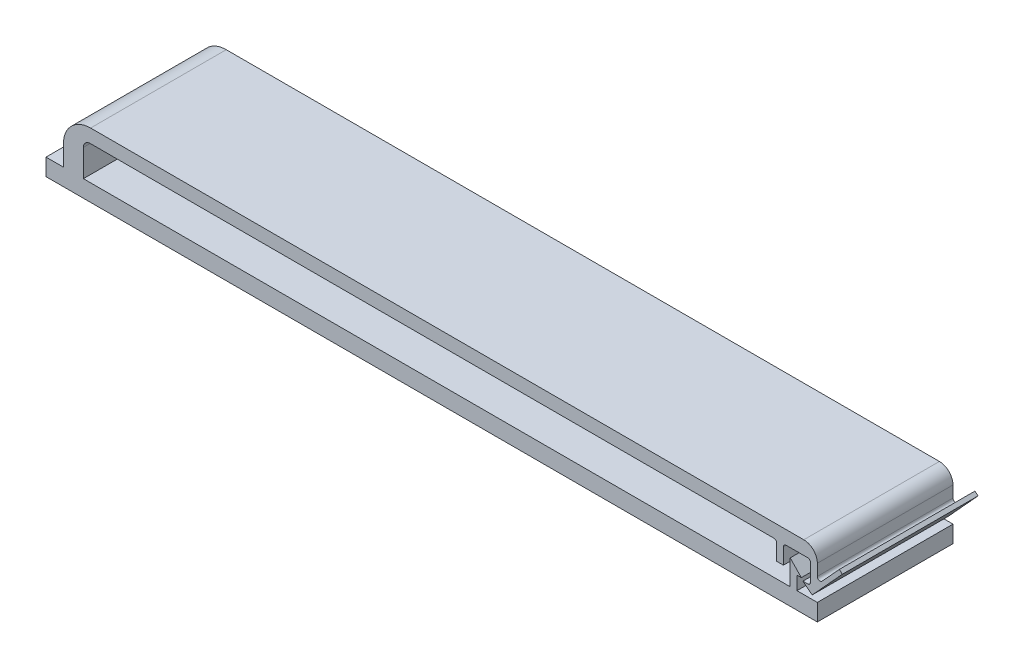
from build123d import *

# Parameters (mm, degrees)
EXTRUDE1_DEPTH = 12.7
FILLET1_R      = 1.27


with BuildPart() as part:
    # Sketch1 → Extrude1 (new body)
    with BuildSketch(Plane.XY):
        with BuildLine():
            Line((70.3072, 1.5875), (70.3072, 2.846013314))
            Line((70.3072, 2.846013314), (70.713191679, 2.846013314))
            Line((70.713191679, 2.846013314), (69.6722, 3.930486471))
            Line((69.6722, 3.930486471), (69.6722, 1.5875))
            Line((69.6722, 1.5875), (3.500510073, 1.5875))
            Line((3.500510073, 1.5875), (3.500510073, 4.1275))
            ThreePointArc((3.500510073, 4.1275), (3.686497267, 4.576512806), (4.135510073, 4.7625))
            Line((4.135510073, 4.7625), (68.1482, 4.7625))
            ThreePointArc((68.1482, 4.7625), (68.327805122, 4.688105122), (68.4022, 4.5085))
            Line((68.4022, 4.5085), (68.4022, 3.017616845))
            Line((68.4022, 3.017616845), (69.0372, 3.017616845))
            Line((69.0372, 3.017616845), (69.0372, 4.5085))
            ThreePointArc((69.0372, 4.5085), (69.111594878, 4.688105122), (69.2912, 4.7625))
            Line((69.2912, 4.7625), (71.3232, 4.7625))
            ThreePointArc((71.3232, 4.7625), (71.502805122, 4.688105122), (71.5772, 4.5085))
            Line((71.5772, 4.5085), (71.5772, 2.887978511))
            ThreePointArc((71.5772, 2.887978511), (71.502805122, 2.708373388), (71.3232, 2.633978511))
            Line((71.3232, 2.633978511), (70.858550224, 2.633978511))
            Line((70.858550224, 2.633978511), (71.733086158, 1.95576697))
            Line((71.733086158, 1.95576697), (74.553755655, 5.040599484))
            Line((74.553755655, 5.040599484), (74.27257808, 5.29769902))
            Line((74.27257808, 5.29769902), (72.653651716, 3.527156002))
            ThreePointArc((72.653651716, 3.527156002), (72.374267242, 3.461776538), (72.2122, 3.698555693))
            Line((72.2122, 3.698555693), (72.2122, 6.0325))
            Line((72.2122, 6.0325), (4.175453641, 6.0325))
            ThreePointArc((4.175453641, 6.0325), (2.379402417, 5.288551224), (1.635453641, 3.4925))
            Line((1.635453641, 3.4925), (1.635453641, 1.5875))
            Line((1.635453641, 1.5875), (0, 1.5875))
            Line((0, 1.5875), (0, 0))
            Line((0, 0), (72.2122, 0))
            Line((72.2122, 0), (72.2122, 1.5875))
            Line((72.2122, 1.5875), (70.3072, 1.5875))
        make_face()
    extrude(amount=-EXTRUDE1_DEPTH)

    # Fillet1
    fillet1_edges = [part.edges().sort_by_distance(p)[0] for p in [
        (72.2122, 6.0325, -6.35),
    ]]
    fillet(fillet1_edges, radius=FILLET1_R)


solid = part.part
